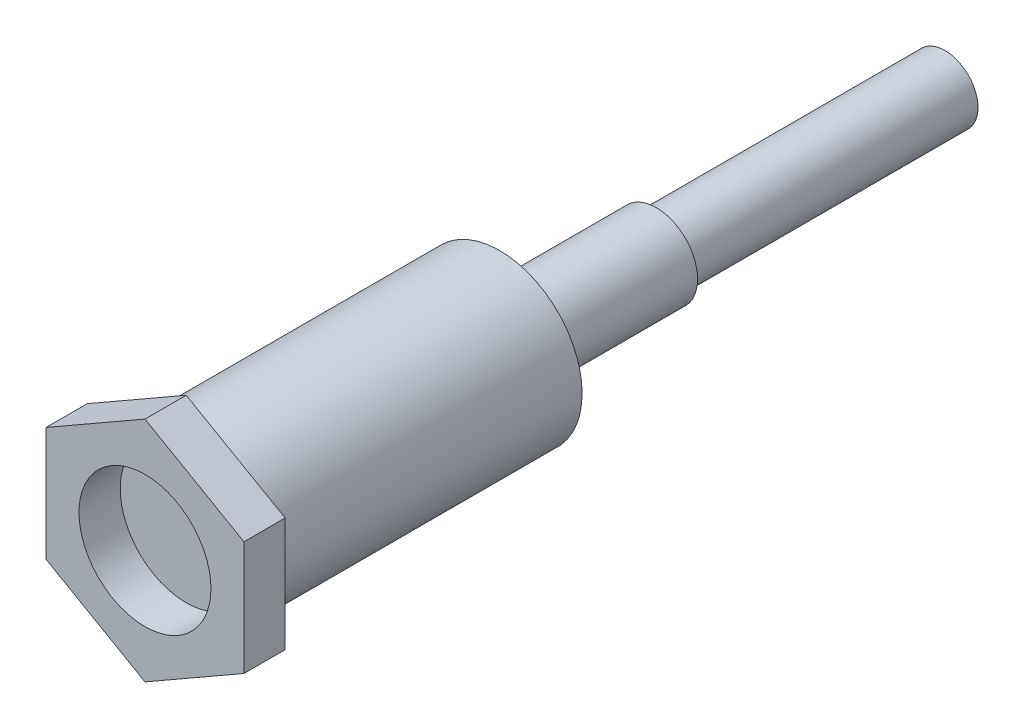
ISO-10303-21;
HEADER;
FILE_DESCRIPTION(('STEP AP214'),'2;1');
FILE_NAME('part.step','',(''),(''),'','','');
FILE_SCHEMA(('AUTOMOTIVE_DESIGN { 1 0 10303 214 1 1 1 1 }'));
ENDSEC;
DATA;
#1=APPLICATION_CONTEXT('core data for automotive mechanical design processes');
#2=APPLICATION_PROTOCOL_DEFINITION('international standard','automotive_design',2000,#1);
#3=PRODUCT_CONTEXT('',#1,'mechanical');
#4=PRODUCT('Part','Part','',(#3));
#5=PRODUCT_RELATED_PRODUCT_CATEGORY('part','',(#4));
#6=PRODUCT_DEFINITION_FORMATION('','',#4);
#7=PRODUCT_DEFINITION_CONTEXT('part definition',#1,'design');
#8=PRODUCT_DEFINITION('design','',#6,#7);
#9=PRODUCT_DEFINITION_SHAPE('','',#8);
#10=(LENGTH_UNIT() NAMED_UNIT(*) SI_UNIT(.MILLI.,.METRE.));
#11=(NAMED_UNIT(*) PLANE_ANGLE_UNIT() SI_UNIT($,.RADIAN.));
#12=(NAMED_UNIT(*) SI_UNIT($,.STERADIAN.) SOLID_ANGLE_UNIT());
#13=UNCERTAINTY_MEASURE_WITH_UNIT(LENGTH_MEASURE(1.E-05),#10,'distance_accuracy_value','');
#14=(GEOMETRIC_REPRESENTATION_CONTEXT(3) GLOBAL_UNCERTAINTY_ASSIGNED_CONTEXT((#13)) GLOBAL_UNIT_ASSIGNED_CONTEXT((#10,
#11,#12)) REPRESENTATION_CONTEXT('',''));
#15=CARTESIAN_POINT('',(0.,0.,0.));
#16=DIRECTION('',(0.,0.,1.));
#17=DIRECTION('',(1.,0.,0.));
#18=AXIS2_PLACEMENT_3D('',#15,#16,#17);
#19=CARTESIAN_POINT('',(-12.,6.91694403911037,0.));
#20=DIRECTION('',(0.,0.,1.));
#21=DIRECTION('',(1.,0.,0.));
#22=AXIS2_PLACEMENT_3D('',#19,#20,#21);
#23=PLANE('',#22);
#24=DIRECTION('',(-0.867435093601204,-0.497550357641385,0.));
#25=VECTOR('',#24,1.);
#26=CARTESIAN_POINT('',(0.,13.8,0.));
#27=LINE('',#26,#25);
#28=CARTESIAN_POINT('',(0.,13.8,0.));
#29=VERTEX_POINT('',#28);
#30=CARTESIAN_POINT('',(-12.,6.91694403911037,0.));
#31=VERTEX_POINT('',#30);
#32=EDGE_CURVE('E88',#29,#31,#27,.T.);
#33=ORIENTED_EDGE('',*,*,#32,.F.);
#34=DIRECTION('',(-0.867435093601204,0.497550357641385,0.));
#35=VECTOR('',#34,1.);
#36=CARTESIAN_POINT('',(0.,13.8,0.));
#37=LINE('',#36,#35);
#38=CARTESIAN_POINT('',(12.,6.91694403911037,0.));
#39=VERTEX_POINT('',#38);
#40=EDGE_CURVE('E115',#39,#29,#37,.T.);
#41=ORIENTED_EDGE('',*,*,#40,.F.);
#42=DIRECTION('',(0.,1.,0.));
#43=VECTOR('',#42,1.);
#44=CARTESIAN_POINT('',(12.,6.91694403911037,0.));
#45=LINE('',#44,#43);
#46=CARTESIAN_POINT('',(12.,-6.91694403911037,0.));
#47=VERTEX_POINT('',#46);
#48=EDGE_CURVE('E113',#47,#39,#45,.T.);
#49=ORIENTED_EDGE('',*,*,#48,.F.);
#50=DIRECTION('',(0.867435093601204,0.497550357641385,0.));
#51=VECTOR('',#50,1.);
#52=CARTESIAN_POINT('',(0.,-13.8,0.));
#53=LINE('',#52,#51);
#54=CARTESIAN_POINT('',(0.,-13.8,0.));
#55=VERTEX_POINT('',#54);
#56=EDGE_CURVE('E111',#55,#47,#53,.T.);
#57=ORIENTED_EDGE('',*,*,#56,.F.);
#58=DIRECTION('',(0.867435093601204,-0.497550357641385,0.));
#59=VECTOR('',#58,1.);
#60=CARTESIAN_POINT('',(0.,-13.8,0.));
#61=LINE('',#60,#59);
#62=CARTESIAN_POINT('',(-12.,-6.91694403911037,0.));
#63=VERTEX_POINT('',#62);
#64=EDGE_CURVE('E90',#63,#55,#61,.T.);
#65=ORIENTED_EDGE('',*,*,#64,.F.);
#66=DIRECTION('',(0.,-1.,0.));
#67=VECTOR('',#66,1.);
#68=CARTESIAN_POINT('',(-12.,6.91694403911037,0.));
#69=LINE('',#68,#67);
#70=EDGE_CURVE('E83',#31,#63,#69,.T.);
#71=ORIENTED_EDGE('',*,*,#70,.F.);
#72=EDGE_LOOP('',(#33,#41,#49,#57,#65,#71));
#73=FACE_BOUND('',#72,.T.);
#74=CARTESIAN_POINT('',(0.,0.,0.));
#75=DIRECTION('',(0.,0.,1.));
#76=DIRECTION('',(1.,0.,0.));
#77=AXIS2_PLACEMENT_3D('',#74,#75,#76);
#78=CIRCLE('',#77,10.);
#79=CARTESIAN_POINT('',(10.,0.,0.));
#80=VERTEX_POINT('',#79);
#81=EDGE_CURVE('E11',#80,#80,#78,.F.);
#82=ORIENTED_EDGE('',*,*,#81,.F.);
#83=EDGE_LOOP('',(#82));
#84=FACE_BOUND('',#83,.T.);
#85=ADVANCED_FACE('F30',(#73,#84),#23,.F.);
#86=CARTESIAN_POINT('',(-12.,6.91694403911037,5.));
#87=DIRECTION('',(0.,0.,1.));
#88=DIRECTION('',(1.,0.,0.));
#89=AXIS2_PLACEMENT_3D('',#86,#87,#88);
#90=PLANE('',#89);
#91=DIRECTION('',(-0.867435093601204,-0.497550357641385,0.));
#92=VECTOR('',#91,1.);
#93=CARTESIAN_POINT('',(0.,13.8,5.));
#94=LINE('',#93,#92);
#95=CARTESIAN_POINT('',(0.,13.8,5.));
#96=VERTEX_POINT('',#95);
#97=CARTESIAN_POINT('',(-12.,6.91694403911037,5.));
#98=VERTEX_POINT('',#97);
#99=EDGE_CURVE('E117',#96,#98,#94,.T.);
#100=ORIENTED_EDGE('',*,*,#99,.T.);
#101=DIRECTION('',(0.,-1.,0.));
#102=VECTOR('',#101,1.);
#103=CARTESIAN_POINT('',(-12.,6.91694403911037,5.));
#104=LINE('',#103,#102);
#105=CARTESIAN_POINT('',(-12.,-6.91694403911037,5.));
#106=VERTEX_POINT('',#105);
#107=EDGE_CURVE('E97',#98,#106,#104,.T.);
#108=ORIENTED_EDGE('',*,*,#107,.T.);
#109=DIRECTION('',(0.867435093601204,-0.497550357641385,0.));
#110=VECTOR('',#109,1.);
#111=CARTESIAN_POINT('',(0.,-13.8,5.));
#112=LINE('',#111,#110);
#113=CARTESIAN_POINT('',(0.,-13.8,5.));
#114=VERTEX_POINT('',#113);
#115=EDGE_CURVE('E120',#106,#114,#112,.T.);
#116=ORIENTED_EDGE('',*,*,#115,.T.);
#117=DIRECTION('',(0.867435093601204,0.497550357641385,0.));
#118=VECTOR('',#117,1.);
#119=CARTESIAN_POINT('',(0.,-13.8,5.));
#120=LINE('',#119,#118);
#121=CARTESIAN_POINT('',(12.,-6.91694403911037,5.));
#122=VERTEX_POINT('',#121);
#123=EDGE_CURVE('E122',#114,#122,#120,.T.);
#124=ORIENTED_EDGE('',*,*,#123,.T.);
#125=DIRECTION('',(0.,1.,0.));
#126=VECTOR('',#125,1.);
#127=CARTESIAN_POINT('',(12.,6.91694403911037,5.));
#128=LINE('',#127,#126);
#129=CARTESIAN_POINT('',(12.,6.91694403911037,5.));
#130=VERTEX_POINT('',#129);
#131=EDGE_CURVE('E50',#122,#130,#128,.T.);
#132=ORIENTED_EDGE('',*,*,#131,.T.);
#133=DIRECTION('',(-0.867435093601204,0.497550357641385,0.));
#134=VECTOR('',#133,1.);
#135=CARTESIAN_POINT('',(0.,13.8,5.));
#136=LINE('',#135,#134);
#137=EDGE_CURVE('E45',#130,#96,#136,.T.);
#138=ORIENTED_EDGE('',*,*,#137,.T.);
#139=EDGE_LOOP('',(#100,#108,#116,#124,#132,#138));
#140=FACE_BOUND('',#139,.T.);
#141=CARTESIAN_POINT('',(0.,0.,5.));
#142=DIRECTION('',(0.,0.,1.));
#143=DIRECTION('',(1.,0.,0.));
#144=AXIS2_PLACEMENT_3D('',#141,#142,#143);
#145=CIRCLE('',#144,8.);
#146=CARTESIAN_POINT('',(8.,0.,5.));
#147=VERTEX_POINT('',#146);
#148=EDGE_CURVE('E103',#147,#147,#145,.T.);
#149=ORIENTED_EDGE('',*,*,#148,.F.);
#150=EDGE_LOOP('',(#149));
#151=FACE_BOUND('',#150,.T.);
#152=ADVANCED_FACE('F141',(#140,#151),#90,.T.);
#153=CARTESIAN_POINT('',(0.,13.8,5.));
#154=DIRECTION('',(0.497550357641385,-0.867435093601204,0.));
#155=DIRECTION('',(0.867435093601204,0.497550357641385,0.));
#156=AXIS2_PLACEMENT_3D('',#153,#154,#155);
#157=PLANE('',#156);
#158=ORIENTED_EDGE('',*,*,#32,.T.);
#159=DIRECTION('',(0.,0.,-1.));
#160=VECTOR('',#159,1.);
#161=CARTESIAN_POINT('',(-12.,6.91694403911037,5.));
#162=LINE('',#161,#160);
#163=EDGE_CURVE('E38',#98,#31,#162,.T.);
#164=ORIENTED_EDGE('',*,*,#163,.F.);
#165=ORIENTED_EDGE('',*,*,#99,.F.);
#166=DIRECTION('',(0.,0.,-1.));
#167=VECTOR('',#166,1.);
#168=CARTESIAN_POINT('',(0.,13.8,5.));
#169=LINE('',#168,#167);
#170=EDGE_CURVE('E102',#96,#29,#169,.T.);
#171=ORIENTED_EDGE('',*,*,#170,.T.);
#172=EDGE_LOOP('',(#158,#164,#165,#171));
#173=FACE_BOUND('',#172,.T.);
#174=ADVANCED_FACE('F32',(#173),#157,.F.);
#175=CARTESIAN_POINT('',(-12.,6.91694403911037,5.));
#176=DIRECTION('',(1.,0.,0.));
#177=DIRECTION('',(0.,0.,-1.));
#178=AXIS2_PLACEMENT_3D('',#175,#176,#177);
#179=PLANE('',#178);
#180=ORIENTED_EDGE('',*,*,#70,.T.);
#181=DIRECTION('',(0.,0.,-1.));
#182=VECTOR('',#181,1.);
#183=CARTESIAN_POINT('',(-12.,-6.91694403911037,5.));
#184=LINE('',#183,#182);
#185=EDGE_CURVE('E100',#106,#63,#184,.T.);
#186=ORIENTED_EDGE('',*,*,#185,.F.);
#187=ORIENTED_EDGE('',*,*,#107,.F.);
#188=ORIENTED_EDGE('',*,*,#163,.T.);
#189=EDGE_LOOP('',(#180,#186,#187,#188));
#190=FACE_BOUND('',#189,.T.);
#191=ADVANCED_FACE('F96',(#190),#179,.F.);
#192=CARTESIAN_POINT('',(0.,-13.8,5.));
#193=DIRECTION('',(0.497550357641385,0.867435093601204,0.));
#194=DIRECTION('',(-0.867435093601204,0.497550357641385,0.));
#195=AXIS2_PLACEMENT_3D('',#192,#193,#194);
#196=PLANE('',#195);
#197=ORIENTED_EDGE('',*,*,#64,.T.);
#198=DIRECTION('',(0.,0.,-1.));
#199=VECTOR('',#198,1.);
#200=CARTESIAN_POINT('',(0.,-13.8,5.));
#201=LINE('',#200,#199);
#202=EDGE_CURVE('E133',#114,#55,#201,.T.);
#203=ORIENTED_EDGE('',*,*,#202,.F.);
#204=ORIENTED_EDGE('',*,*,#115,.F.);
#205=ORIENTED_EDGE('',*,*,#185,.T.);
#206=EDGE_LOOP('',(#197,#203,#204,#205));
#207=FACE_BOUND('',#206,.T.);
#208=ADVANCED_FACE('F138',(#207),#196,.F.);
#209=CARTESIAN_POINT('',(0.,-13.8,5.));
#210=DIRECTION('',(-0.497550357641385,0.867435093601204,0.));
#211=DIRECTION('',(-0.867435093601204,-0.497550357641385,0.));
#212=AXIS2_PLACEMENT_3D('',#209,#210,#211);
#213=PLANE('',#212);
#214=ORIENTED_EDGE('',*,*,#56,.T.);
#215=DIRECTION('',(0.,0.,-1.));
#216=VECTOR('',#215,1.);
#217=CARTESIAN_POINT('',(12.,-6.91694403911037,5.));
#218=LINE('',#217,#216);
#219=EDGE_CURVE('E130',#122,#47,#218,.T.);
#220=ORIENTED_EDGE('',*,*,#219,.F.);
#221=ORIENTED_EDGE('',*,*,#123,.F.);
#222=ORIENTED_EDGE('',*,*,#202,.T.);
#223=EDGE_LOOP('',(#214,#220,#221,#222));
#224=FACE_BOUND('',#223,.T.);
#225=ADVANCED_FACE('F145',(#224),#213,.F.);
#226=CARTESIAN_POINT('',(12.,6.91694403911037,5.));
#227=DIRECTION('',(-1.,0.,0.));
#228=DIRECTION('',(0.,0.,1.));
#229=AXIS2_PLACEMENT_3D('',#226,#227,#228);
#230=PLANE('',#229);
#231=ORIENTED_EDGE('',*,*,#48,.T.);
#232=DIRECTION('',(0.,0.,-1.));
#233=VECTOR('',#232,1.);
#234=CARTESIAN_POINT('',(12.,6.91694403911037,5.));
#235=LINE('',#234,#233);
#236=EDGE_CURVE('E127',#130,#39,#235,.T.);
#237=ORIENTED_EDGE('',*,*,#236,.F.);
#238=ORIENTED_EDGE('',*,*,#131,.F.);
#239=ORIENTED_EDGE('',*,*,#219,.T.);
#240=EDGE_LOOP('',(#231,#237,#238,#239));
#241=FACE_BOUND('',#240,.T.);
#242=ADVANCED_FACE('F148',(#241),#230,.F.);
#243=CARTESIAN_POINT('',(0.,13.8,5.));
#244=DIRECTION('',(-0.497550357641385,-0.867435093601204,0.));
#245=DIRECTION('',(0.867435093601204,-0.497550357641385,0.));
#246=AXIS2_PLACEMENT_3D('',#243,#244,#245);
#247=PLANE('',#246);
#248=ORIENTED_EDGE('',*,*,#40,.T.);
#249=ORIENTED_EDGE('',*,*,#170,.F.);
#250=ORIENTED_EDGE('',*,*,#137,.F.);
#251=ORIENTED_EDGE('',*,*,#236,.T.);
#252=EDGE_LOOP('',(#248,#249,#250,#251));
#253=FACE_BOUND('',#252,.T.);
#254=ADVANCED_FACE('F150',(#253),#247,.F.);
#255=CARTESIAN_POINT('',(0.,0.,5.));
#256=DIRECTION('',(0.,0.,-1.));
#257=DIRECTION('',(-1.,0.,0.));
#258=AXIS2_PLACEMENT_3D('',#255,#256,#257);
#259=CYLINDRICAL_SURFACE('',#258,8.);
#260=ORIENTED_EDGE('',*,*,#148,.T.);
#261=EDGE_LOOP('',(#260));
#262=FACE_BOUND('',#261,.T.);
#263=CARTESIAN_POINT('',(0.,0.,0.));
#264=DIRECTION('',(0.,0.,1.));
#265=DIRECTION('',(1.,0.,0.));
#266=AXIS2_PLACEMENT_3D('',#263,#264,#265);
#267=CIRCLE('',#266,8.);
#268=CARTESIAN_POINT('',(8.,0.,0.));
#269=VERTEX_POINT('',#268);
#270=EDGE_CURVE('E106',#269,#269,#267,.T.);
#271=ORIENTED_EDGE('',*,*,#270,.F.);
#272=EDGE_LOOP('',(#271));
#273=FACE_BOUND('',#272,.T.);
#274=ADVANCED_FACE('F152',(#262,#273),#259,.F.);
#275=CARTESIAN_POINT('',(0.,0.,0.));
#276=DIRECTION('',(0.,0.,-1.));
#277=DIRECTION('',(-1.,0.,0.));
#278=AXIS2_PLACEMENT_3D('',#275,#276,#277);
#279=PLANE('',#278);
#280=ORIENTED_EDGE('',*,*,#270,.T.);
#281=EDGE_LOOP('',(#280));
#282=FACE_BOUND('',#281,.T.);
#283=ADVANCED_FACE('F158',(#282),#279,.F.);
#284=CARTESIAN_POINT('',(-4.,0.,-92.));
#285=DIRECTION('',(0.,0.,1.));
#286=DIRECTION('',(1.,0.,0.));
#287=AXIS2_PLACEMENT_3D('',#284,#285,#286);
#288=PLANE('',#287);
#289=CARTESIAN_POINT('',(0.,0.,-92.));
#290=DIRECTION('',(0.,0.,1.));
#291=DIRECTION('',(1.,0.,0.));
#292=AXIS2_PLACEMENT_3D('',#289,#290,#291);
#293=CIRCLE('',#292,4.);
#294=CARTESIAN_POINT('',(4.,0.,-92.));
#295=VERTEX_POINT('',#294);
#296=EDGE_CURVE('E212',#295,#295,#293,.T.);
#297=ORIENTED_EDGE('',*,*,#296,.F.);
#298=EDGE_LOOP('',(#297));
#299=FACE_BOUND('',#298,.T.);
#300=ADVANCED_FACE('F169',(#299),#288,.F.);
#301=CARTESIAN_POINT('',(0.,0.,5.));
#302=DIRECTION('',(0.,0.,1.));
#303=DIRECTION('',(1.,0.,0.));
#304=AXIS2_PLACEMENT_3D('',#301,#302,#303);
#305=CYLINDRICAL_SURFACE('',#304,4.);
#306=CARTESIAN_POINT('',(0.,0.,-57.5));
#307=DIRECTION('',(0.,0.,1.));
#308=DIRECTION('',(1.,0.,0.));
#309=AXIS2_PLACEMENT_3D('',#306,#307,#308);
#310=CIRCLE('',#309,4.);
#311=CARTESIAN_POINT('',(4.,0.,-57.5));
#312=VERTEX_POINT('',#311);
#313=EDGE_CURVE('E214',#312,#312,#310,.T.);
#314=ORIENTED_EDGE('',*,*,#313,.F.);
#315=EDGE_LOOP('',(#314));
#316=FACE_BOUND('',#315,.T.);
#317=ORIENTED_EDGE('',*,*,#296,.T.);
#318=EDGE_LOOP('',(#317));
#319=FACE_BOUND('',#318,.T.);
#320=ADVANCED_FACE('F172',(#316,#319),#305,.T.);
#321=CARTESIAN_POINT('',(0.,0.,-57.5));
#322=DIRECTION('',(0.,0.,1.));
#323=DIRECTION('',(1.,0.,0.));
#324=AXIS2_PLACEMENT_3D('',#321,#322,#323);
#325=CONICAL_SURFACE('',#324,4.,0.785398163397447);
#326=CARTESIAN_POINT('',(0.,0.,-57.));
#327=DIRECTION('',(0.,0.,1.));
#328=DIRECTION('',(1.,0.,0.));
#329=AXIS2_PLACEMENT_3D('',#326,#327,#328);
#330=CIRCLE('',#329,4.5);
#331=CARTESIAN_POINT('',(4.5,0.,-57.));
#332=VERTEX_POINT('',#331);
#333=EDGE_CURVE('E219',#332,#332,#330,.T.);
#334=ORIENTED_EDGE('',*,*,#333,.F.);
#335=EDGE_LOOP('',(#334));
#336=FACE_BOUND('',#335,.T.);
#337=ORIENTED_EDGE('',*,*,#313,.T.);
#338=EDGE_LOOP('',(#337));
#339=FACE_BOUND('',#338,.T.);
#340=ADVANCED_FACE('F176',(#336,#339),#325,.T.);
#341=CARTESIAN_POINT('',(-5.,0.,-57.));
#342=DIRECTION('',(0.,0.,1.));
#343=DIRECTION('',(1.,0.,0.));
#344=AXIS2_PLACEMENT_3D('',#341,#342,#343);
#345=PLANE('',#344);
#346=CARTESIAN_POINT('',(0.,0.,-57.));
#347=DIRECTION('',(0.,0.,1.));
#348=DIRECTION('',(1.,0.,0.));
#349=AXIS2_PLACEMENT_3D('',#346,#347,#348);
#350=CIRCLE('',#349,5.);
#351=CARTESIAN_POINT('',(5.,0.,-57.));
#352=VERTEX_POINT('',#351);
#353=EDGE_CURVE('E222',#352,#352,#350,.T.);
#354=ORIENTED_EDGE('',*,*,#353,.F.);
#355=EDGE_LOOP('',(#354));
#356=FACE_BOUND('',#355,.T.);
#357=ORIENTED_EDGE('',*,*,#333,.T.);
#358=EDGE_LOOP('',(#357));
#359=FACE_BOUND('',#358,.T.);
#360=ADVANCED_FACE('F180',(#356,#359),#345,.F.);
#361=CARTESIAN_POINT('',(0.,0.,5.));
#362=DIRECTION('',(0.,0.,1.));
#363=DIRECTION('',(1.,0.,0.));
#364=AXIS2_PLACEMENT_3D('',#361,#362,#363);
#365=CYLINDRICAL_SURFACE('',#364,5.);
#366=CARTESIAN_POINT('',(0.,0.,-41.));
#367=DIRECTION('',(0.,0.,1.));
#368=DIRECTION('',(1.,0.,0.));
#369=AXIS2_PLACEMENT_3D('',#366,#367,#368);
#370=CIRCLE('',#369,5.);
#371=CARTESIAN_POINT('',(5.,0.,-41.));
#372=VERTEX_POINT('',#371);
#373=EDGE_CURVE('E225',#372,#372,#370,.T.);
#374=ORIENTED_EDGE('',*,*,#373,.F.);
#375=EDGE_LOOP('',(#374));
#376=FACE_BOUND('',#375,.T.);
#377=ORIENTED_EDGE('',*,*,#353,.T.);
#378=EDGE_LOOP('',(#377));
#379=FACE_BOUND('',#378,.T.);
#380=ADVANCED_FACE('F184',(#376,#379),#365,.T.);
#381=CARTESIAN_POINT('',(-4.,0.,-41.));
#382=DIRECTION('',(0.,0.,-1.));
#383=DIRECTION('',(-1.,0.,0.));
#384=AXIS2_PLACEMENT_3D('',#381,#382,#383);
#385=PLANE('',#384);
#386=CARTESIAN_POINT('',(0.,0.,-41.));
#387=DIRECTION('',(0.,0.,1.));
#388=DIRECTION('',(1.,0.,0.));
#389=AXIS2_PLACEMENT_3D('',#386,#387,#388);
#390=CIRCLE('',#389,4.);
#391=CARTESIAN_POINT('',(4.,0.,-41.));
#392=VERTEX_POINT('',#391);
#393=EDGE_CURVE('E228',#392,#392,#390,.T.);
#394=ORIENTED_EDGE('',*,*,#393,.F.);
#395=EDGE_LOOP('',(#394));
#396=FACE_BOUND('',#395,.T.);
#397=ORIENTED_EDGE('',*,*,#373,.T.);
#398=EDGE_LOOP('',(#397));
#399=FACE_BOUND('',#398,.T.);
#400=ADVANCED_FACE('F188',(#396,#399),#385,.F.);
#401=CARTESIAN_POINT('',(0.,0.,5.));
#402=DIRECTION('',(0.,0.,1.));
#403=DIRECTION('',(1.,0.,0.));
#404=AXIS2_PLACEMENT_3D('',#401,#402,#403);
#405=CYLINDRICAL_SURFACE('',#404,4.);
#406=CARTESIAN_POINT('',(0.,0.,-38.));
#407=DIRECTION('',(0.,0.,1.));
#408=DIRECTION('',(1.,0.,0.));
#409=AXIS2_PLACEMENT_3D('',#406,#407,#408);
#410=CIRCLE('',#409,4.);
#411=CARTESIAN_POINT('',(4.,0.,-38.));
#412=VERTEX_POINT('',#411);
#413=EDGE_CURVE('E231',#412,#412,#410,.T.);
#414=ORIENTED_EDGE('',*,*,#413,.F.);
#415=EDGE_LOOP('',(#414));
#416=FACE_BOUND('',#415,.T.);
#417=ORIENTED_EDGE('',*,*,#393,.T.);
#418=EDGE_LOOP('',(#417));
#419=FACE_BOUND('',#418,.T.);
#420=ADVANCED_FACE('F192',(#416,#419),#405,.T.);
#421=CARTESIAN_POINT('',(-10.,0.,-38.));
#422=DIRECTION('',(0.,0.,1.));
#423=DIRECTION('',(1.,0.,0.));
#424=AXIS2_PLACEMENT_3D('',#421,#422,#423);
#425=PLANE('',#424);
#426=CARTESIAN_POINT('',(0.,0.,-38.));
#427=DIRECTION('',(0.,0.,1.));
#428=DIRECTION('',(1.,0.,0.));
#429=AXIS2_PLACEMENT_3D('',#426,#427,#428);
#430=CIRCLE('',#429,10.);
#431=CARTESIAN_POINT('',(10.,0.,-38.));
#432=VERTEX_POINT('',#431);
#433=EDGE_CURVE('E234',#432,#432,#430,.T.);
#434=ORIENTED_EDGE('',*,*,#433,.F.);
#435=EDGE_LOOP('',(#434));
#436=FACE_BOUND('',#435,.T.);
#437=ORIENTED_EDGE('',*,*,#413,.T.);
#438=EDGE_LOOP('',(#437));
#439=FACE_BOUND('',#438,.T.);
#440=ADVANCED_FACE('F196',(#436,#439),#425,.F.);
#441=CARTESIAN_POINT('',(0.,0.,5.));
#442=DIRECTION('',(0.,0.,1.));
#443=DIRECTION('',(1.,0.,0.));
#444=AXIS2_PLACEMENT_3D('',#441,#442,#443);
#445=CYLINDRICAL_SURFACE('',#444,10.);
#446=ORIENTED_EDGE('',*,*,#81,.T.);
#447=EDGE_LOOP('',(#446));
#448=FACE_BOUND('',#447,.T.);
#449=ORIENTED_EDGE('',*,*,#433,.T.);
#450=EDGE_LOOP('',(#449));
#451=FACE_BOUND('',#450,.T.);
#452=ADVANCED_FACE('F200',(#448,#451),#445,.T.);
#453=CLOSED_SHELL('',(#85,#152,#174,#191,#208,#225,#242,#254,#274,#283,#300,#320,#340,#360,#380,
#400,#420,#440,#452));
#454=MANIFOLD_SOLID_BREP('B2',#453);
#455=ADVANCED_BREP_SHAPE_REPRESENTATION('',(#18,#454),#14);
#456=SHAPE_DEFINITION_REPRESENTATION(#9,#455);
ENDSEC;
END-ISO-10303-21;
